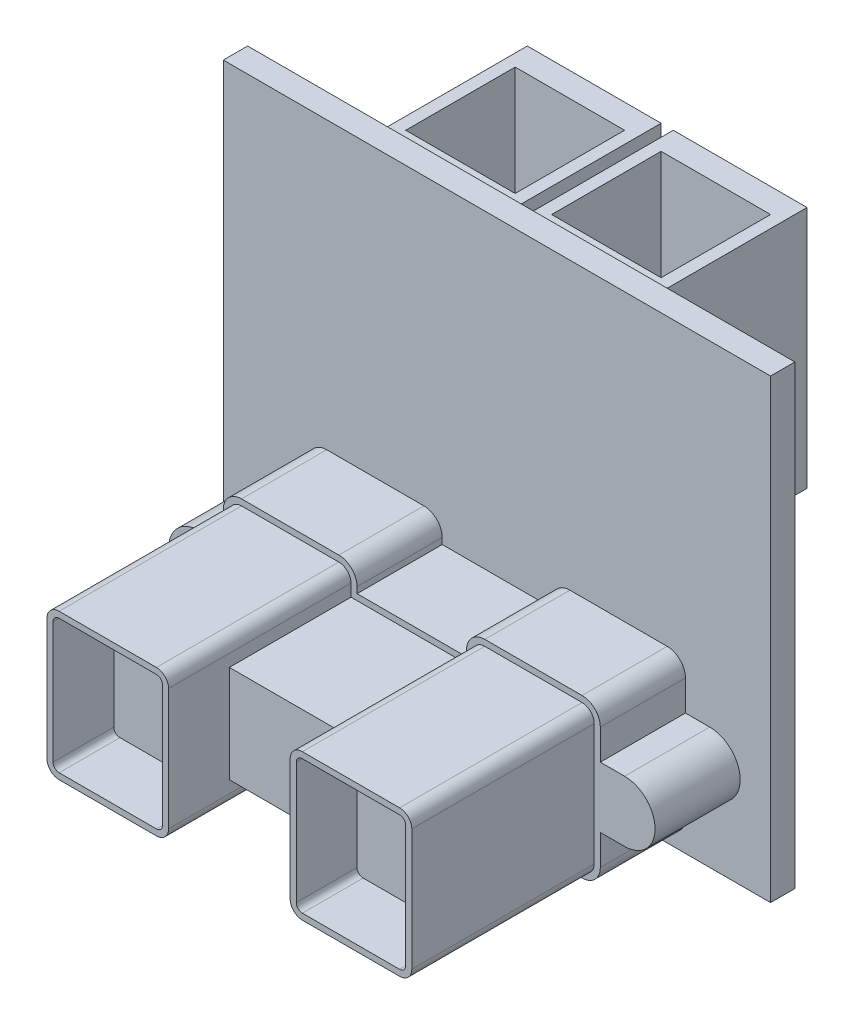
from build123d import *

# Parameters (mm, degrees)
SKETCH1_W           = 45
SKETCH1_H           = 37.5
BOSS_EXTRUDE1_DEPTH = 2
SKETCH2_W           = 40
SKETCH2_H           = 13
BOSS_EXTRUDE2_DEPTH = 7
BOSS_EXTRUDE3_DEPTH = 15
FILLET1_R           = 1
SKETCH4_W           = 10
SKETCH4_H           = 8
CUT_EXTRUDE1_DEPTH  = 5
SKETCH5_W           = 41
SKETCH5_H           = 14
CUT_EXTRUDE2_DEPTH  = 7
SKETCH6_W           = 11
SKETCH6_H           = 20
BOSS_EXTRUDE5_DEPTH = 12
SKETCH7_W           = 9
SKETCH7_H           = 9
CUT_EXTRUDE3_DEPTH  = 12


with BuildPart() as part:
    # Sketch1 → Boss-Extrude1 (new body)
    with BuildSketch(Plane.XY):
        Rectangle(SKETCH1_W, SKETCH1_H)
    extrude(amount=BOSS_EXTRUDE1_DEPTH)

    # Sketch2 → Boss-Extrude2 (add)
    with BuildSketch(Plane.XY.offset(2)):
        with Locations((0, -11.25)):
            Rectangle(SKETCH2_W, SKETCH2_H)
    extrude(amount=BOSS_EXTRUDE2_DEPTH)

    # Sketch3 → Boss-Extrude3 (add)
    with BuildSketch(Plane.XY.offset(9)):
        Polygon((-5, -7.25), (-5, -5.25), (-15, -5.25), (-15, -17.25), (-5, -17.25), (-5, -15.25), (5, -15.25), (5, -17.25), (15, -17.25), (15, -5.25), (5, -5.25), (5, -7.25), align=None)
    extrude(amount=BOSS_EXTRUDE3_DEPTH)

    # Fillet1
    fillet1_edges = [part.edges().sort_by_distance(p)[0] for p in [
        (5, -5.25, 16.5),
        (-5, -5.25, 16.5),
        (-15, -5.25, 16.5),
        (-15, -17.25, 16.5),
        (-5, -17.25, 16.5),
        (5, -17.25, 16.5),
        (15, -17.25, 16.5),
        (15, -5.25, 16.5),
    ]]
    fillet(fillet1_edges, radius=FILLET1_R)

    # Sketch4 → Cut-Extrude1 (cut)
    with BuildSketch(Plane.XY.offset(24)):
        with BuildLine():
            Line((-5.5, -14.75), (-5.5, -7.75))
            Line((-5.5, -7.75), (-5.5, -6.25))
            ThreePointArc((-5.5, -6.25), (-5.646446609, -5.896446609), (-6, -5.75))
            Line((-6, -5.75), (-14, -5.75))
            ThreePointArc((-14, -5.75), (-14.353553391, -5.896446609), (-14.5, -6.25))
            Line((-14.5, -6.25), (-14.5, -16.25))
            ThreePointArc((-14.5, -16.25), (-14.353553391, -16.603553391), (-14, -16.75))
            Line((-14, -16.75), (-6, -16.75))
            ThreePointArc((-6, -16.75), (-5.646446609, -16.603553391), (-5.5, -16.25))
            Line((-5.5, -16.25), (-5.5, -14.75))
        make_face()
        with BuildLine():
            Line((5.5, -7.75), (5.5, -14.75))
            Line((5.5, -14.75), (5.5, -16.25))
            ThreePointArc((5.5, -16.25), (5.646446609, -16.603553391), (6, -16.75))
            Line((6, -16.75), (14, -16.75))
            ThreePointArc((14, -16.75), (14.353553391, -16.603553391), (14.5, -16.25))
            Line((14.5, -16.25), (14.5, -6.25))
            ThreePointArc((14.5, -6.25), (14.353553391, -5.896446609), (14, -5.75))
            Line((14, -5.75), (6, -5.75))
            ThreePointArc((6, -5.75), (5.646446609, -5.896446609), (5.5, -6.25))
            Line((5.5, -6.25), (5.5, -7.75))
        make_face()
        with Locations((0, -11.25)):
            Rectangle(SKETCH4_W, SKETCH4_H)
    extrude(amount=-CUT_EXTRUDE1_DEPTH, mode=Mode.SUBTRACT)

    # Sketch5 → Cut-Extrude2 (cut)
    with BuildSketch(Plane.XY.offset(9)):
        with Locations((0, -11.25)):
            Rectangle(SKETCH5_W, SKETCH5_H)
        with BuildLine():
            Line((-14, -17.75), (-6, -17.75))
            ThreePointArc((-6, -17.75), (-4.939339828, -17.310660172), (-4.5, -16.25))
            Line((-4.5, -16.25), (-4.5, -15.75))
            Line((-4.5, -15.75), (4.5, -15.75))
            Line((4.5, -15.75), (4.5, -16.25))
            ThreePointArc((4.5, -16.25), (4.939339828, -17.310660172), (6, -17.75))
            Line((6, -17.75), (14, -17.75))
            ThreePointArc((14, -17.75), (15.060660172, -17.310660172), (15.5, -16.25))
            Line((15.5, -16.25), (15.5, -13.75))
            Line((15.5, -13.75), (17.5, -13.75))
            ThreePointArc((17.5, -13.75), (20, -11.25), (17.5, -8.75))
            Line((17.5, -8.75), (15.5, -8.75))
            Line((15.5, -8.75), (15.5, -6.25))
            ThreePointArc((15.5, -6.25), (15.060660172, -5.189339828), (14, -4.75))
            Line((14, -4.75), (6, -4.75))
            ThreePointArc((6, -4.75), (4.939339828, -5.189339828), (4.5, -6.25))
            Line((4.5, -6.25), (4.5, -6.75))
            Line((4.5, -6.75), (-4.5, -6.75))
            Line((-4.5, -6.75), (-4.5, -6.25))
            ThreePointArc((-4.5, -6.25), (-4.939339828, -5.189339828), (-6, -4.75))
            Line((-6, -4.75), (-14, -4.75))
            ThreePointArc((-14, -4.75), (-15.060660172, -5.189339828), (-15.5, -6.25))
            Line((-15.5, -6.25), (-15.5, -8.75))
            Line((-15.5, -8.75), (-17.5, -8.75))
            ThreePointArc((-17.5, -8.75), (-20, -11.25), (-17.5, -13.75))
            Line((-17.5, -13.75), (-15.5, -13.75))
            Line((-15.5, -13.75), (-15.5, -16.25))
            ThreePointArc((-15.5, -16.25), (-15.060660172, -17.310660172), (-14, -17.75))
        make_face(mode=Mode.SUBTRACT)
    extrude(amount=-CUT_EXTRUDE2_DEPTH, mode=Mode.SUBTRACT)

    # Sketch6 → Boss-Extrude5 (add)
    with BuildSketch(Plane(origin=(0, 0, 0), x_dir=(-1, 0, 0), z_dir=(0, 0, -1))):
        with Locations((-6, 8.25)):
            Rectangle(SKETCH6_W, SKETCH6_H)
        with Locations((6, 8.25)):
            Rectangle(SKETCH6_W, SKETCH6_H)
    extrude(amount=BOSS_EXTRUDE5_DEPTH)

    # Sketch7 → Cut-Extrude3 (cut)
    with BuildSketch(Plane(origin=(0, 18.25, 0), x_dir=(1, 0, 0), z_dir=(0, 1, 0))):
        with Locations((-6, 5.5)):
            Rectangle(SKETCH7_W, SKETCH7_H)
        with Locations((6, 5.5)):
            Rectangle(SKETCH7_W, SKETCH7_H)
    extrude(amount=-CUT_EXTRUDE3_DEPTH, mode=Mode.SUBTRACT)


solid = part.part
